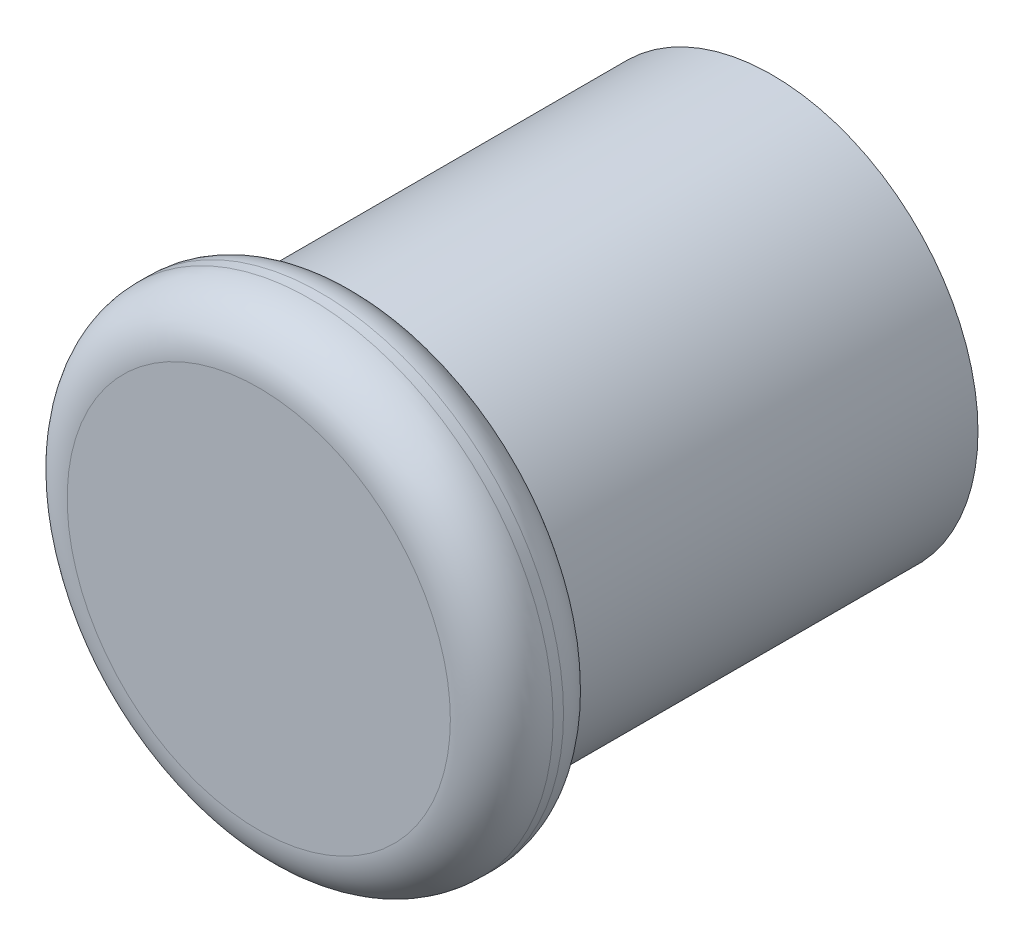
ISO-10303-21;
HEADER;
FILE_DESCRIPTION(('STEP AP214'),'2;1');
FILE_NAME('part.step','',(''),(''),'','','');
FILE_SCHEMA(('AUTOMOTIVE_DESIGN { 1 0 10303 214 1 1 1 1 }'));
ENDSEC;
DATA;
#1=APPLICATION_CONTEXT('core data for automotive mechanical design processes');
#2=APPLICATION_PROTOCOL_DEFINITION('international standard','automotive_design',2000,#1);
#3=PRODUCT_CONTEXT('',#1,'mechanical');
#4=PRODUCT('Part','Part','',(#3));
#5=PRODUCT_RELATED_PRODUCT_CATEGORY('part','',(#4));
#6=PRODUCT_DEFINITION_FORMATION('','',#4);
#7=PRODUCT_DEFINITION_CONTEXT('part definition',#1,'design');
#8=PRODUCT_DEFINITION('design','',#6,#7);
#9=PRODUCT_DEFINITION_SHAPE('','',#8);
#10=(LENGTH_UNIT() NAMED_UNIT(*) SI_UNIT(.MILLI.,.METRE.));
#11=(NAMED_UNIT(*) PLANE_ANGLE_UNIT() SI_UNIT($,.RADIAN.));
#12=(NAMED_UNIT(*) SI_UNIT($,.STERADIAN.) SOLID_ANGLE_UNIT());
#13=UNCERTAINTY_MEASURE_WITH_UNIT(LENGTH_MEASURE(1.E-05),#10,'distance_accuracy_value','');
#14=(GEOMETRIC_REPRESENTATION_CONTEXT(3) GLOBAL_UNCERTAINTY_ASSIGNED_CONTEXT((#13)) GLOBAL_UNIT_ASSIGNED_CONTEXT((#10,
#11,#12)) REPRESENTATION_CONTEXT('',''));
#15=CARTESIAN_POINT('',(0.,0.,0.));
#16=DIRECTION('',(0.,0.,1.));
#17=DIRECTION('',(1.,0.,0.));
#18=AXIS2_PLACEMENT_3D('',#15,#16,#17);
#19=CARTESIAN_POINT('',(0.,0.,20.));
#20=DIRECTION('',(0.,0.,-1.));
#21=DIRECTION('',(-1.,0.,0.));
#22=AXIS2_PLACEMENT_3D('',#19,#20,#21);
#23=CYLINDRICAL_SURFACE('',#22,10.0203263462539);
#24=CARTESIAN_POINT('',(0.,0.,20.));
#25=DIRECTION('',(0.,0.,1.));
#26=DIRECTION('',(1.,0.,0.));
#27=AXIS2_PLACEMENT_3D('',#24,#25,#26);
#28=CIRCLE('',#27,10.0203263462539);
#29=CARTESIAN_POINT('',(10.0203263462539,0.,20.));
#30=VERTEX_POINT('',#29);
#31=EDGE_CURVE('E44',#30,#30,#28,.T.);
#32=ORIENTED_EDGE('',*,*,#31,.F.);
#33=EDGE_LOOP('',(#32));
#34=FACE_BOUND('',#33,.T.);
#35=CARTESIAN_POINT('',(0.,0.,0.));
#36=DIRECTION('',(0.,0.,1.));
#37=DIRECTION('',(1.,0.,0.));
#38=AXIS2_PLACEMENT_3D('',#35,#36,#37);
#39=CIRCLE('',#38,10.0203263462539);
#40=CARTESIAN_POINT('',(10.0203263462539,0.,0.));
#41=VERTEX_POINT('',#40);
#42=EDGE_CURVE('E47',#41,#41,#39,.T.);
#43=ORIENTED_EDGE('',*,*,#42,.T.);
#44=EDGE_LOOP('',(#43));
#45=FACE_BOUND('',#44,.T.);
#46=ADVANCED_FACE('F29',(#34,#45),#23,.T.);
#47=CARTESIAN_POINT('',(0.,0.,0.));
#48=DIRECTION('',(0.,0.,1.));
#49=DIRECTION('',(1.,0.,0.));
#50=AXIS2_PLACEMENT_3D('',#47,#48,#49);
#51=PLANE('',#50);
#52=CARTESIAN_POINT('',(0.,0.,0.));
#53=DIRECTION('',(0.,0.,-1.));
#54=DIRECTION('',(-1.,0.,0.));
#55=AXIS2_PLACEMENT_3D('',#52,#53,#54);
#56=CIRCLE('',#55,1.5);
#57=CARTESIAN_POINT('',(-1.5,0.,0.));
#58=VERTEX_POINT('',#57);
#59=EDGE_CURVE('E53',#58,#58,#56,.T.);
#60=ORIENTED_EDGE('',*,*,#59,.F.);
#61=EDGE_LOOP('',(#60));
#62=FACE_BOUND('',#61,.T.);
#63=ORIENTED_EDGE('',*,*,#42,.F.);
#64=EDGE_LOOP('',(#63));
#65=FACE_BOUND('',#64,.T.);
#66=ADVANCED_FACE('F67',(#62,#65),#51,.F.);
#67=CARTESIAN_POINT('',(0.,0.,25.));
#68=DIRECTION('',(0.,0.,-1.));
#69=DIRECTION('',(-1.,0.,0.));
#70=AXIS2_PLACEMENT_3D('',#67,#68,#69);
#71=CYLINDRICAL_SURFACE('',#70,11.828858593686);
#72=CARTESIAN_POINT('',(0.,0.,21.9908139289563));
#73=DIRECTION('',(0.,0.,-1.));
#74=DIRECTION('',(-1.,0.,0.));
#75=AXIS2_PLACEMENT_3D('',#72,#73,#74);
#76=CIRCLE('',#75,11.828858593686);
#77=CARTESIAN_POINT('',(-11.828858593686,0.,21.9908139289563));
#78=VERTEX_POINT('',#77);
#79=EDGE_CURVE('E10',#78,#78,#76,.F.);
#80=ORIENTED_EDGE('',*,*,#79,.T.);
#81=EDGE_LOOP('',(#80));
#82=FACE_BOUND('',#81,.T.);
#83=CARTESIAN_POINT('',(0.,0.,22.5));
#84=DIRECTION('',(0.,0.,1.));
#85=DIRECTION('',(1.,0.,0.));
#86=AXIS2_PLACEMENT_3D('',#83,#84,#85);
#87=CIRCLE('',#86,11.828858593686);
#88=CARTESIAN_POINT('',(11.828858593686,0.,22.5));
#89=VERTEX_POINT('',#88);
#90=EDGE_CURVE('E36',#89,#89,#87,.F.);
#91=ORIENTED_EDGE('',*,*,#90,.T.);
#92=EDGE_LOOP('',(#91));
#93=FACE_BOUND('',#92,.T.);
#94=ADVANCED_FACE('F70',(#82,#93),#71,.T.);
#95=CARTESIAN_POINT('',(0.,0.,25.));
#96=DIRECTION('',(0.,0.,1.));
#97=DIRECTION('',(1.,0.,0.));
#98=AXIS2_PLACEMENT_3D('',#95,#96,#97);
#99=PLANE('',#98);
#100=CARTESIAN_POINT('',(0.,0.,25.));
#101=DIRECTION('',(0.,0.,1.));
#102=DIRECTION('',(1.,0.,0.));
#103=AXIS2_PLACEMENT_3D('',#100,#101,#102);
#104=CIRCLE('',#103,9.328858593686);
#105=CARTESIAN_POINT('',(9.328858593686,0.,25.));
#106=VERTEX_POINT('',#105);
#107=EDGE_CURVE('E40',#106,#106,#104,.T.);
#108=ORIENTED_EDGE('',*,*,#107,.T.);
#109=EDGE_LOOP('',(#108));
#110=FACE_BOUND('',#109,.T.);
#111=ADVANCED_FACE('F83',(#110),#99,.T.);
#112=CARTESIAN_POINT('',(0.,0.,22.5));
#113=DIRECTION('',(0.,0.,1.));
#114=DIRECTION('',(1.,0.,0.));
#115=AXIS2_PLACEMENT_3D('',#112,#113,#114);
#116=TOROIDAL_SURFACE('',#115,9.328858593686,2.5);
#117=ORIENTED_EDGE('',*,*,#90,.F.);
#118=EDGE_LOOP('',(#117));
#119=FACE_BOUND('',#118,.T.);
#120=ORIENTED_EDGE('',*,*,#107,.F.);
#121=EDGE_LOOP('',(#120));
#122=FACE_BOUND('',#121,.T.);
#123=ADVANCED_FACE('F81',(#119,#122),#116,.T.);
#124=CARTESIAN_POINT('',(0.,0.,21.9908139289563));
#125=DIRECTION('',(0.,0.,-1.));
#126=DIRECTION('',(-1.,0.,0.));
#127=AXIS2_PLACEMENT_3D('',#124,#125,#126);
#128=TOROIDAL_SURFACE('',#127,9.828858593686,2.);
#129=ORIENTED_EDGE('',*,*,#31,.T.);
#130=EDGE_LOOP('',(#129));
#131=FACE_BOUND('',#130,.T.);
#132=ORIENTED_EDGE('',*,*,#79,.F.);
#133=EDGE_LOOP('',(#132));
#134=FACE_BOUND('',#133,.T.);
#135=ADVANCED_FACE('F31',(#131,#134),#128,.T.);
#136=CARTESIAN_POINT('',(0.,0.,15.));
#137=DIRECTION('',(0.,0.,-1.));
#138=DIRECTION('',(-1.,0.,0.));
#139=AXIS2_PLACEMENT_3D('',#136,#137,#138);
#140=CYLINDRICAL_SURFACE('',#139,1.5);
#141=CARTESIAN_POINT('',(0.,0.,15.));
#142=DIRECTION('',(0.,0.,-1.));
#143=DIRECTION('',(-1.,0.,0.));
#144=AXIS2_PLACEMENT_3D('',#141,#142,#143);
#145=CIRCLE('',#144,1.5);
#146=CARTESIAN_POINT('',(-1.5,0.,15.));
#147=VERTEX_POINT('',#146);
#148=EDGE_CURVE('E50',#147,#147,#145,.T.);
#149=ORIENTED_EDGE('',*,*,#148,.F.);
#150=EDGE_LOOP('',(#149));
#151=FACE_BOUND('',#150,.T.);
#152=ORIENTED_EDGE('',*,*,#59,.T.);
#153=EDGE_LOOP('',(#152));
#154=FACE_BOUND('',#153,.T.);
#155=ADVANCED_FACE('F61',(#151,#154),#140,.F.);
#156=CARTESIAN_POINT('',(0.,0.,15.));
#157=DIRECTION('',(0.,0.,-1.));
#158=DIRECTION('',(-1.,0.,0.));
#159=AXIS2_PLACEMENT_3D('',#156,#157,#158);
#160=PLANE('',#159);
#161=ORIENTED_EDGE('',*,*,#148,.T.);
#162=EDGE_LOOP('',(#161));
#163=FACE_BOUND('',#162,.T.);
#164=ADVANCED_FACE('F59',(#163),#160,.T.);
#165=CLOSED_SHELL('',(#46,#66,#94,#111,#123,#135,#155,#164));
#166=MANIFOLD_SOLID_BREP('B2',#165);
#167=ADVANCED_BREP_SHAPE_REPRESENTATION('',(#18,#166),#14);
#168=SHAPE_DEFINITION_REPRESENTATION(#9,#167);
ENDSEC;
END-ISO-10303-21;
